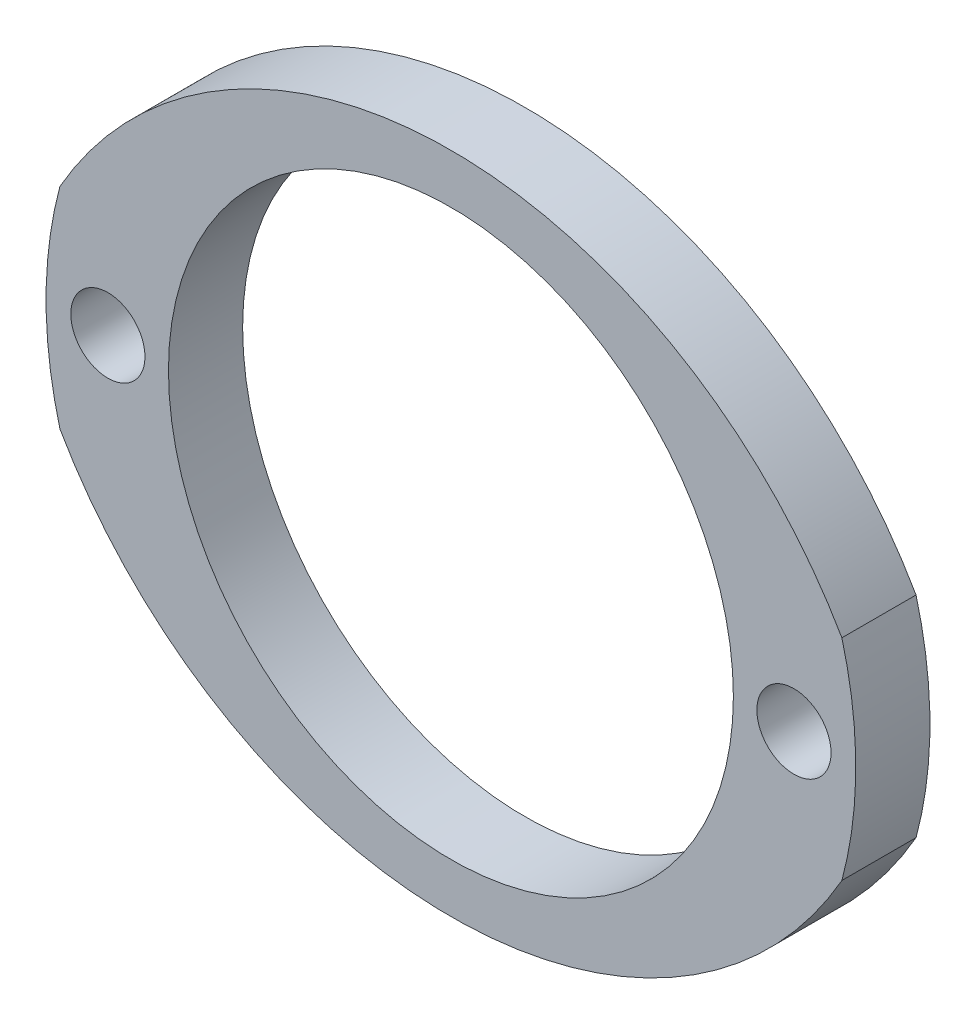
ISO-10303-21;
HEADER;
FILE_DESCRIPTION(('STEP AP214'),'2;1');
FILE_NAME('part.step','',(''),(''),'','','');
FILE_SCHEMA(('AUTOMOTIVE_DESIGN { 1 0 10303 214 1 1 1 1 }'));
ENDSEC;
DATA;
#1=APPLICATION_CONTEXT('core data for automotive mechanical design processes');
#2=APPLICATION_PROTOCOL_DEFINITION('international standard','automotive_design',2000,#1);
#3=PRODUCT_CONTEXT('',#1,'mechanical');
#4=PRODUCT('Part','Part','',(#3));
#5=PRODUCT_RELATED_PRODUCT_CATEGORY('part','',(#4));
#6=PRODUCT_DEFINITION_FORMATION('','',#4);
#7=PRODUCT_DEFINITION_CONTEXT('part definition',#1,'design');
#8=PRODUCT_DEFINITION('design','',#6,#7);
#9=PRODUCT_DEFINITION_SHAPE('','',#8);
#10=(LENGTH_UNIT() NAMED_UNIT(*) SI_UNIT(.MILLI.,.METRE.));
#11=(NAMED_UNIT(*) PLANE_ANGLE_UNIT() SI_UNIT($,.RADIAN.));
#12=(NAMED_UNIT(*) SI_UNIT($,.STERADIAN.) SOLID_ANGLE_UNIT());
#13=UNCERTAINTY_MEASURE_WITH_UNIT(LENGTH_MEASURE(1.E-05),#10,'distance_accuracy_value','');
#14=(GEOMETRIC_REPRESENTATION_CONTEXT(3) GLOBAL_UNCERTAINTY_ASSIGNED_CONTEXT((#13)) GLOBAL_UNIT_ASSIGNED_CONTEXT((#10,
#11,#12)) REPRESENTATION_CONTEXT('',''));
#15=CARTESIAN_POINT('',(0.,0.,0.));
#16=DIRECTION('',(0.,0.,1.));
#17=DIRECTION('',(1.,0.,0.));
#18=AXIS2_PLACEMENT_3D('',#15,#16,#17);
#19=CARTESIAN_POINT('',(-86.749230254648,395.375831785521,3.));
#20=DIRECTION('',(0.,0.,1.));
#21=DIRECTION('',(1.,0.,0.));
#22=AXIS2_PLACEMENT_3D('',#19,#20,#21);
#23=PLANE('',#22);
#24=CARTESIAN_POINT('',(-100.624230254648,397.771231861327,3.));
#25=DIRECTION('',(0.,0.,1.));
#26=DIRECTION('',(1.,0.,0.));
#27=AXIS2_PLACEMENT_3D('',#24,#25,#26);
#28=CIRCLE('',#27,1.5);
#29=CARTESIAN_POINT('',(-99.1242302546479,397.771231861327,3.));
#30=VERTEX_POINT('',#29);
#31=EDGE_CURVE('E142',#30,#30,#28,.T.);
#32=ORIENTED_EDGE('',*,*,#31,.F.);
#33=EDGE_LOOP('',(#32));
#34=FACE_BOUND('',#33,.T.);
#35=CARTESIAN_POINT('',(-86.749230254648,392.980431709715,3.));
#36=DIRECTION('',(0.,0.,1.));
#37=DIRECTION('',(1.,0.,0.));
#38=AXIS2_PLACEMENT_3D('',#35,#36,#37);
#39=CIRCLE('',#38,18.2158001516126);
#40=CARTESIAN_POINT('',(-70.935404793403,402.021355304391,3.));
#41=VERTEX_POINT('',#40);
#42=CARTESIAN_POINT('',(-102.563055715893,402.021355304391,3.));
#43=VERTEX_POINT('',#42);
#44=EDGE_CURVE('E99',#41,#43,#39,.T.);
#45=ORIENTED_EDGE('',*,*,#44,.T.);
#46=CARTESIAN_POINT('',(-86.749230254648,397.771231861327,3.));
#47=DIRECTION('',(0.,0.,1.));
#48=DIRECTION('',(1.,0.,0.));
#49=AXIS2_PLACEMENT_3D('',#46,#47,#48);
#50=CIRCLE('',#49,16.375);
#51=CARTESIAN_POINT('',(-102.563055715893,393.521108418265,3.));
#52=VERTEX_POINT('',#51);
#53=EDGE_CURVE('E94',#43,#52,#50,.T.);
#54=ORIENTED_EDGE('',*,*,#53,.T.);
#55=CARTESIAN_POINT('',(-86.749230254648,402.56203201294,3.));
#56=DIRECTION('',(0.,0.,1.));
#57=DIRECTION('',(1.,0.,0.));
#58=AXIS2_PLACEMENT_3D('',#55,#56,#57);
#59=CIRCLE('',#58,18.2158001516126);
#60=CARTESIAN_POINT('',(-70.9354047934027,393.521108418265,3.));
#61=VERTEX_POINT('',#60);
#62=EDGE_CURVE('E97',#52,#61,#59,.T.);
#63=ORIENTED_EDGE('',*,*,#62,.T.);
#64=CARTESIAN_POINT('',(-86.749230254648,397.771231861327,3.));
#65=DIRECTION('',(0.,0.,1.));
#66=DIRECTION('',(1.,0.,0.));
#67=AXIS2_PLACEMENT_3D('',#64,#65,#66);
#68=CIRCLE('',#67,16.3749999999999);
#69=EDGE_CURVE('E58',#61,#41,#68,.T.);
#70=ORIENTED_EDGE('',*,*,#69,.T.);
#71=EDGE_LOOP('',(#45,#54,#63,#70));
#72=FACE_BOUND('',#71,.T.);
#73=CARTESIAN_POINT('',(-72.874230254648,397.771231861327,3.));
#74=DIRECTION('',(0.,0.,1.));
#75=DIRECTION('',(1.,0.,0.));
#76=AXIS2_PLACEMENT_3D('',#73,#74,#75);
#77=CIRCLE('',#76,1.5);
#78=CARTESIAN_POINT('',(-71.374230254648,397.771231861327,3.));
#79=VERTEX_POINT('',#78);
#80=EDGE_CURVE('E121',#79,#79,#77,.T.);
#81=ORIENTED_EDGE('',*,*,#80,.F.);
#82=EDGE_LOOP('',(#81));
#83=FACE_BOUND('',#82,.T.);
#84=CARTESIAN_POINT('',(-86.749230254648,397.771231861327,3.));
#85=DIRECTION('',(0.,0.,1.));
#86=DIRECTION('',(1.,0.,0.));
#87=AXIS2_PLACEMENT_3D('',#84,#85,#86);
#88=CIRCLE('',#87,11.425);
#89=CARTESIAN_POINT('',(-75.3242302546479,397.771231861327,3.));
#90=VERTEX_POINT('',#89);
#91=EDGE_CURVE('E150',#90,#90,#88,.T.);
#92=ORIENTED_EDGE('',*,*,#91,.F.);
#93=EDGE_LOOP('',(#92));
#94=FACE_BOUND('',#93,.T.);
#95=ADVANCED_FACE('F38',(#34,#72,#83,#94),#23,.T.);
#96=CARTESIAN_POINT('',(-86.749230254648,395.375831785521,0.));
#97=DIRECTION('',(0.,0.,1.));
#98=DIRECTION('',(1.,0.,0.));
#99=AXIS2_PLACEMENT_3D('',#96,#97,#98);
#100=PLANE('',#99);
#101=CARTESIAN_POINT('',(-86.749230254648,392.980431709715,0.));
#102=DIRECTION('',(0.,0.,1.));
#103=DIRECTION('',(1.,0.,0.));
#104=AXIS2_PLACEMENT_3D('',#101,#102,#103);
#105=CIRCLE('',#104,18.2158001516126);
#106=CARTESIAN_POINT('',(-70.935404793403,402.021355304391,0.));
#107=VERTEX_POINT('',#106);
#108=CARTESIAN_POINT('',(-102.563055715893,402.021355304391,0.));
#109=VERTEX_POINT('',#108);
#110=EDGE_CURVE('E117',#107,#109,#105,.T.);
#111=ORIENTED_EDGE('',*,*,#110,.F.);
#112=CARTESIAN_POINT('',(-86.749230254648,397.771231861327,0.));
#113=DIRECTION('',(0.,0.,1.));
#114=DIRECTION('',(1.,0.,0.));
#115=AXIS2_PLACEMENT_3D('',#112,#113,#114);
#116=CIRCLE('',#115,16.3749999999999);
#117=CARTESIAN_POINT('',(-70.9354047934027,393.521108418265,0.));
#118=VERTEX_POINT('',#117);
#119=EDGE_CURVE('E86',#118,#107,#116,.T.);
#120=ORIENTED_EDGE('',*,*,#119,.F.);
#121=CARTESIAN_POINT('',(-86.749230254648,402.56203201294,0.));
#122=DIRECTION('',(0.,0.,1.));
#123=DIRECTION('',(1.,0.,0.));
#124=AXIS2_PLACEMENT_3D('',#121,#122,#123);
#125=CIRCLE('',#124,18.2158001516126);
#126=CARTESIAN_POINT('',(-102.563055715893,393.521108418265,0.));
#127=VERTEX_POINT('',#126);
#128=EDGE_CURVE('E79',#127,#118,#125,.T.);
#129=ORIENTED_EDGE('',*,*,#128,.F.);
#130=CARTESIAN_POINT('',(-86.749230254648,397.771231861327,0.));
#131=DIRECTION('',(0.,0.,1.));
#132=DIRECTION('',(1.,0.,0.));
#133=AXIS2_PLACEMENT_3D('',#130,#131,#132);
#134=CIRCLE('',#133,16.375);
#135=EDGE_CURVE('E104',#109,#127,#134,.T.);
#136=ORIENTED_EDGE('',*,*,#135,.F.);
#137=EDGE_LOOP('',(#111,#120,#129,#136));
#138=FACE_BOUND('',#137,.T.);
#139=CARTESIAN_POINT('',(-72.874230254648,397.771231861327,0.));
#140=DIRECTION('',(0.,0.,1.));
#141=DIRECTION('',(1.,0.,0.));
#142=AXIS2_PLACEMENT_3D('',#139,#140,#141);
#143=CIRCLE('',#142,1.5);
#144=CARTESIAN_POINT('',(-71.374230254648,397.771231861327,0.));
#145=VERTEX_POINT('',#144);
#146=EDGE_CURVE('E138',#145,#145,#143,.T.);
#147=ORIENTED_EDGE('',*,*,#146,.T.);
#148=EDGE_LOOP('',(#147));
#149=FACE_BOUND('',#148,.T.);
#150=CARTESIAN_POINT('',(-100.624230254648,397.771231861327,0.));
#151=DIRECTION('',(0.,0.,1.));
#152=DIRECTION('',(1.,0.,0.));
#153=AXIS2_PLACEMENT_3D('',#150,#151,#152);
#154=CIRCLE('',#153,1.5);
#155=CARTESIAN_POINT('',(-99.1242302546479,397.771231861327,0.));
#156=VERTEX_POINT('',#155);
#157=EDGE_CURVE('E146',#156,#156,#154,.T.);
#158=ORIENTED_EDGE('',*,*,#157,.T.);
#159=EDGE_LOOP('',(#158));
#160=FACE_BOUND('',#159,.T.);
#161=CARTESIAN_POINT('',(-86.749230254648,397.771231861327,0.));
#162=DIRECTION('',(0.,0.,1.));
#163=DIRECTION('',(1.,0.,0.));
#164=AXIS2_PLACEMENT_3D('',#161,#162,#163);
#165=CIRCLE('',#164,11.425);
#166=CARTESIAN_POINT('',(-75.3242302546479,397.771231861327,0.));
#167=VERTEX_POINT('',#166);
#168=EDGE_CURVE('E154',#167,#167,#165,.T.);
#169=ORIENTED_EDGE('',*,*,#168,.T.);
#170=EDGE_LOOP('',(#169));
#171=FACE_BOUND('',#170,.T.);
#172=ADVANCED_FACE('F132',(#138,#149,#160,#171),#100,.F.);
#173=CARTESIAN_POINT('',(-86.749230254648,392.980431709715,3.));
#174=DIRECTION('',(0.,0.,-1.));
#175=DIRECTION('',(-1.,0.,0.));
#176=AXIS2_PLACEMENT_3D('',#173,#174,#175);
#177=CYLINDRICAL_SURFACE('',#176,18.2158001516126);
#178=ORIENTED_EDGE('',*,*,#110,.T.);
#179=DIRECTION('',(0.,0.,-1.));
#180=VECTOR('',#179,1.);
#181=CARTESIAN_POINT('',(-102.563055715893,402.021355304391,3.));
#182=LINE('',#181,#180);
#183=EDGE_CURVE('E11',#43,#109,#182,.T.);
#184=ORIENTED_EDGE('',*,*,#183,.F.);
#185=ORIENTED_EDGE('',*,*,#44,.F.);
#186=DIRECTION('',(0.,0.,-1.));
#187=VECTOR('',#186,1.);
#188=CARTESIAN_POINT('',(-70.935404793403,402.021355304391,3.));
#189=LINE('',#188,#187);
#190=EDGE_CURVE('E113',#41,#107,#189,.T.);
#191=ORIENTED_EDGE('',*,*,#190,.T.);
#192=EDGE_LOOP('',(#178,#184,#185,#191));
#193=FACE_BOUND('',#192,.T.);
#194=ADVANCED_FACE('F40',(#193),#177,.T.);
#195=CARTESIAN_POINT('',(-86.749230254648,397.771231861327,3.));
#196=DIRECTION('',(0.,0.,-1.));
#197=DIRECTION('',(-1.,0.,0.));
#198=AXIS2_PLACEMENT_3D('',#195,#196,#197);
#199=CYLINDRICAL_SURFACE('',#198,16.375);
#200=ORIENTED_EDGE('',*,*,#135,.T.);
#201=DIRECTION('',(0.,0.,-1.));
#202=VECTOR('',#201,1.);
#203=CARTESIAN_POINT('',(-102.563055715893,393.521108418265,3.));
#204=LINE('',#203,#202);
#205=EDGE_CURVE('E48',#52,#127,#204,.T.);
#206=ORIENTED_EDGE('',*,*,#205,.F.);
#207=ORIENTED_EDGE('',*,*,#53,.F.);
#208=ORIENTED_EDGE('',*,*,#183,.T.);
#209=EDGE_LOOP('',(#200,#206,#207,#208));
#210=FACE_BOUND('',#209,.T.);
#211=ADVANCED_FACE('F103',(#210),#199,.T.);
#212=CARTESIAN_POINT('',(-86.749230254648,402.56203201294,3.));
#213=DIRECTION('',(0.,0.,-1.));
#214=DIRECTION('',(-1.,0.,0.));
#215=AXIS2_PLACEMENT_3D('',#212,#213,#214);
#216=CYLINDRICAL_SURFACE('',#215,18.2158001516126);
#217=ORIENTED_EDGE('',*,*,#128,.T.);
#218=DIRECTION('',(0.,0.,-1.));
#219=VECTOR('',#218,1.);
#220=CARTESIAN_POINT('',(-70.9354047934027,393.521108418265,3.));
#221=LINE('',#220,#219);
#222=EDGE_CURVE('E106',#61,#118,#221,.T.);
#223=ORIENTED_EDGE('',*,*,#222,.F.);
#224=ORIENTED_EDGE('',*,*,#62,.F.);
#225=ORIENTED_EDGE('',*,*,#205,.T.);
#226=EDGE_LOOP('',(#217,#223,#224,#225));
#227=FACE_BOUND('',#226,.T.);
#228=ADVANCED_FACE('F107',(#227),#216,.T.);
#229=CARTESIAN_POINT('',(-86.749230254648,397.771231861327,3.));
#230=DIRECTION('',(0.,0.,-1.));
#231=DIRECTION('',(-1.,0.,0.));
#232=AXIS2_PLACEMENT_3D('',#229,#230,#231);
#233=CYLINDRICAL_SURFACE('',#232,16.3749999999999);
#234=ORIENTED_EDGE('',*,*,#119,.T.);
#235=ORIENTED_EDGE('',*,*,#190,.F.);
#236=ORIENTED_EDGE('',*,*,#69,.F.);
#237=ORIENTED_EDGE('',*,*,#222,.T.);
#238=EDGE_LOOP('',(#234,#235,#236,#237));
#239=FACE_BOUND('',#238,.T.);
#240=ADVANCED_FACE('F129',(#239),#233,.T.);
#241=CARTESIAN_POINT('',(-72.874230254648,397.771231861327,3.));
#242=DIRECTION('',(0.,0.,-1.));
#243=DIRECTION('',(-1.,0.,0.));
#244=AXIS2_PLACEMENT_3D('',#241,#242,#243);
#245=CYLINDRICAL_SURFACE('',#244,1.5);
#246=ORIENTED_EDGE('',*,*,#80,.T.);
#247=EDGE_LOOP('',(#246));
#248=FACE_BOUND('',#247,.T.);
#249=ORIENTED_EDGE('',*,*,#146,.F.);
#250=EDGE_LOOP('',(#249));
#251=FACE_BOUND('',#250,.T.);
#252=ADVANCED_FACE('F173',(#248,#251),#245,.F.);
#253=CARTESIAN_POINT('',(-100.624230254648,397.771231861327,3.));
#254=DIRECTION('',(0.,0.,-1.));
#255=DIRECTION('',(-1.,0.,0.));
#256=AXIS2_PLACEMENT_3D('',#253,#254,#255);
#257=CYLINDRICAL_SURFACE('',#256,1.5);
#258=ORIENTED_EDGE('',*,*,#31,.T.);
#259=EDGE_LOOP('',(#258));
#260=FACE_BOUND('',#259,.T.);
#261=ORIENTED_EDGE('',*,*,#157,.F.);
#262=EDGE_LOOP('',(#261));
#263=FACE_BOUND('',#262,.T.);
#264=ADVANCED_FACE('F203',(#260,#263),#257,.F.);
#265=CARTESIAN_POINT('',(-86.749230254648,397.771231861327,3.));
#266=DIRECTION('',(0.,0.,-1.));
#267=DIRECTION('',(-1.,0.,0.));
#268=AXIS2_PLACEMENT_3D('',#265,#266,#267);
#269=CYLINDRICAL_SURFACE('',#268,11.425);
#270=ORIENTED_EDGE('',*,*,#91,.T.);
#271=EDGE_LOOP('',(#270));
#272=FACE_BOUND('',#271,.T.);
#273=ORIENTED_EDGE('',*,*,#168,.F.);
#274=EDGE_LOOP('',(#273));
#275=FACE_BOUND('',#274,.T.);
#276=ADVANCED_FACE('F161',(#272,#275),#269,.F.);
#277=CLOSED_SHELL('',(#95,#172,#194,#211,#228,#240,#252,#264,#276));
#278=MANIFOLD_SOLID_BREP('B2',#277);
#279=ADVANCED_BREP_SHAPE_REPRESENTATION('',(#18,#278),#14);
#280=SHAPE_DEFINITION_REPRESENTATION(#9,#279);
ENDSEC;
END-ISO-10303-21;
